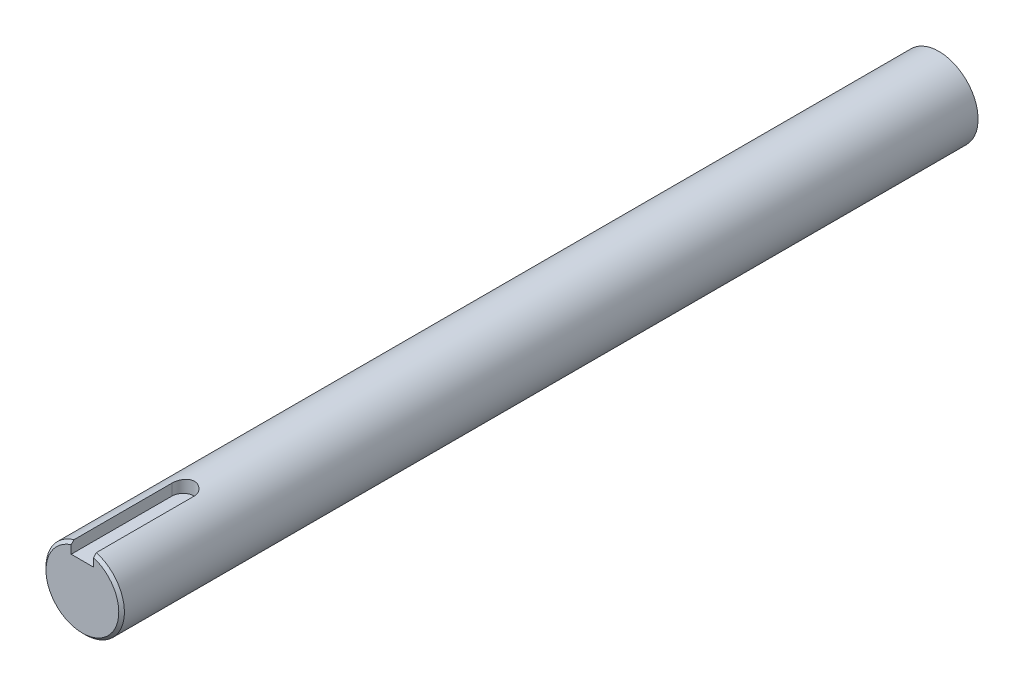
ISO-10303-21;
HEADER;
FILE_DESCRIPTION(('STEP AP214'),'2;1');
FILE_NAME('part.step','',(''),(''),'','','');
FILE_SCHEMA(('AUTOMOTIVE_DESIGN { 1 0 10303 214 1 1 1 1 }'));
ENDSEC;
DATA;
#1=APPLICATION_CONTEXT('core data for automotive mechanical design processes');
#2=APPLICATION_PROTOCOL_DEFINITION('international standard','automotive_design',2000,#1);
#3=PRODUCT_CONTEXT('',#1,'mechanical');
#4=PRODUCT('Part','Part','',(#3));
#5=PRODUCT_RELATED_PRODUCT_CATEGORY('part','',(#4));
#6=PRODUCT_DEFINITION_FORMATION('','',#4);
#7=PRODUCT_DEFINITION_CONTEXT('part definition',#1,'design');
#8=PRODUCT_DEFINITION('design','',#6,#7);
#9=PRODUCT_DEFINITION_SHAPE('','',#8);
#10=(LENGTH_UNIT() NAMED_UNIT(*) SI_UNIT(.MILLI.,.METRE.));
#11=(NAMED_UNIT(*) PLANE_ANGLE_UNIT() SI_UNIT($,.RADIAN.));
#12=(NAMED_UNIT(*) SI_UNIT($,.STERADIAN.) SOLID_ANGLE_UNIT());
#13=UNCERTAINTY_MEASURE_WITH_UNIT(LENGTH_MEASURE(1.E-05),#10,'distance_accuracy_value','');
#14=(GEOMETRIC_REPRESENTATION_CONTEXT(3) GLOBAL_UNCERTAINTY_ASSIGNED_CONTEXT((#13)) GLOBAL_UNIT_ASSIGNED_CONTEXT((#10,
#11,#12)) REPRESENTATION_CONTEXT('',''));
#15=CARTESIAN_POINT('',(0.,0.,0.));
#16=DIRECTION('',(0.,0.,1.));
#17=DIRECTION('',(1.,0.,0.));
#18=AXIS2_PLACEMENT_3D('',#15,#16,#17);
#19=CARTESIAN_POINT('',(0.,0.,98.));
#20=DIRECTION('',(0.,0.,-1.));
#21=DIRECTION('',(-1.,0.,0.));
#22=AXIS2_PLACEMENT_3D('',#19,#20,#21);
#23=CYLINDRICAL_SURFACE('',#22,7.);
#24=DIRECTION('',(0.,0.,-1.));
#25=VECTOR('',#24,1.);
#26=CARTESIAN_POINT('',(2.,6.70820393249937,98.));
#27=LINE('',#26,#25);
#28=CARTESIAN_POINT('',(2.,6.70820393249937,97.5));
#29=VERTEX_POINT('',#28);
#30=CARTESIAN_POINT('',(2.,6.70820393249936,80.));
#31=VERTEX_POINT('',#30);
#32=EDGE_CURVE('E103',#29,#31,#27,.T.);
#33=ORIENTED_EDGE('',*,*,#32,.F.);
#34=CARTESIAN_POINT('',(0.,0.,97.5));
#35=DIRECTION('',(0.,0.,1.));
#36=DIRECTION('',(1.,0.,0.));
#37=AXIS2_PLACEMENT_3D('',#34,#35,#36);
#38=CIRCLE('',#37,7.);
#39=CARTESIAN_POINT('',(-2.,6.70820393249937,97.5));
#40=VERTEX_POINT('',#39);
#41=EDGE_CURVE('E48',#29,#40,#38,.F.);
#42=ORIENTED_EDGE('',*,*,#41,.T.);
#43=DIRECTION('',(0.,0.,-1.));
#44=VECTOR('',#43,1.);
#45=CARTESIAN_POINT('',(-2.,6.70820393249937,98.));
#46=LINE('',#45,#44);
#47=CARTESIAN_POINT('',(-2.,6.70820393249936,80.));
#48=VERTEX_POINT('',#47);
#49=EDGE_CURVE('E114',#40,#48,#46,.T.);
#50=ORIENTED_EDGE('',*,*,#49,.T.);
#51=CARTESIAN_POINT('',(2.,6.70820393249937,80.));
#52=CARTESIAN_POINT('',(2.00000099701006,6.70819953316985,79.9449659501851));
#53=CARTESIAN_POINT('',(1.99772698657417,6.70888204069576,79.8899594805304));
#54=CARTESIAN_POINT('',(1.988664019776,6.71157572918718,79.7803637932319));
#55=CARTESIAN_POINT('',(1.98187599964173,6.71358663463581,79.7257744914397));
#56=CARTESIAN_POINT('',(1.95485062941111,6.72152750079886,79.563492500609));
#57=CARTESIAN_POINT('',(1.92795143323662,6.72936619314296,79.4569243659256));
#58=CARTESIAN_POINT('',(1.85729763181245,6.74920530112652,79.2500599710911));
#59=CARTESIAN_POINT('',(1.81354760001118,6.76120458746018,79.1497620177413));
#60=CARTESIAN_POINT('',(1.7105009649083,6.78800504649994,78.9578633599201));
#61=CARTESIAN_POINT('',(1.65119805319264,6.80280735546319,78.8662662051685));
#62=CARTESIAN_POINT('',(1.51692637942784,6.83401742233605,78.6918092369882));
#63=CARTESIAN_POINT('',(1.44159286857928,6.85045675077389,78.6092358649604));
#64=CARTESIAN_POINT('',(1.27817556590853,6.88281888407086,78.4577009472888));
#65=CARTESIAN_POINT('',(1.19008966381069,6.89874160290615,78.3887416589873));
#66=CARTESIAN_POINT('',(1.00164390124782,6.92863365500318,78.2651698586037));
#67=CARTESIAN_POINT('',(0.901086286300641,6.94256116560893,78.210847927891));
#68=CARTESIAN_POINT('',(0.69180361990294,6.96652585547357,78.1199966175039));
#69=CARTESIAN_POINT('',(0.583080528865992,6.9765639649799,78.0834629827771));
#70=CARTESIAN_POINT('',(0.363559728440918,6.99139511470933,78.0301658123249));
#71=CARTESIAN_POINT('',(0.252890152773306,6.9963181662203,78.0129113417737));
#72=CARTESIAN_POINT('',(0.0301224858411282,7.0008209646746,77.9971132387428));
#73=CARTESIAN_POINT('',(-0.0819753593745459,7.00040161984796,77.9985664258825));
#74=CARTESIAN_POINT('',(-0.300980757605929,6.99436005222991,78.0198064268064));
#75=CARTESIAN_POINT('',(-0.40794465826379,6.98888865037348,78.0390618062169));
#76=CARTESIAN_POINT('',(-0.617053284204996,6.97353876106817,78.0944954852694));
#77=CARTESIAN_POINT('',(-0.719197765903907,6.96366005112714,78.1306746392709));
#78=CARTESIAN_POINT('',(-0.917074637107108,6.94039022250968,78.2193097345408));
#79=CARTESIAN_POINT('',(-1.01272458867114,6.92696183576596,78.2719395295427));
#80=CARTESIAN_POINT('',(-1.19400864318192,6.89802743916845,78.3918457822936));
#81=CARTESIAN_POINT('',(-1.27964070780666,6.88252100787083,78.4591252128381));
#82=CARTESIAN_POINT('',(-1.4416242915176,6.85045847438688,78.6091975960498));
#83=CARTESIAN_POINT('',(-1.51754611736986,6.83388462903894,78.6924510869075));
#84=CARTESIAN_POINT('',(-1.65448071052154,6.8020328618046,78.8706972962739));
#85=CARTESIAN_POINT('',(-1.71548924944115,6.78675530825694,78.9656933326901));
#86=CARTESIAN_POINT('',(-1.82126577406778,6.75914312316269,79.165787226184));
#87=CARTESIAN_POINT('',(-1.86589126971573,6.74683461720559,79.2709641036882));
#88=CARTESIAN_POINT('',(-1.93662306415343,6.72687625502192,79.4877120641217));
#89=CARTESIAN_POINT('',(-1.96275743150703,6.71921934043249,79.5992731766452));
#90=CARTESIAN_POINT('',(-1.98612021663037,6.71232934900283,79.7598794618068));
#91=CARTESIAN_POINT('',(-1.99132502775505,6.71078540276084,79.807779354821));
#92=CARTESIAN_POINT('',(-1.99826154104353,6.7087227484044,79.9037782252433));
#93=CARTESIAN_POINT('',(-1.99999854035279,6.70820247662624,79.9518767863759));
#94=CARTESIAN_POINT('',(-2.,6.70820393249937,80.));
#95=B_SPLINE_CURVE_WITH_KNOTS('',3,(#51,#52,#53,#54,#55,#56,#57,#58,#59,#60,#61,#62,#63,#64,#65,
#66,#67,#68,#69,#70,#71,#72,#73,#74,#75,#76,#77,#78,#79,#80,#81,#82,#83,#84,#85,#86,#87,#88,#89,
#90,#91,#92,#93,#94),.UNSPECIFIED.,.F.,.F.,(4,2,2,2,2,2,2,2,2,2,2,2,2,2,2,2,2,2,2,2,2,4),(0.,
0.164996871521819,0.32995953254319,0.658815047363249,0.987581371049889,1.3164812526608,
1.65386790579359,1.99131045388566,2.33502692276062,2.67866113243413,3.01332990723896,
3.34794178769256,3.67287650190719,3.99782762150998,4.32633613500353,4.65491137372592,
4.99498620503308,5.33515734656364,5.67822068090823,6.0207621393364,6.16526974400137,
6.30955644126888),.UNSPECIFIED.);
#96=EDGE_CURVE('E97',#31,#48,#95,.T.);
#97=ORIENTED_EDGE('',*,*,#96,.F.);
#98=EDGE_LOOP('',(#33,#42,#50,#97));
#99=FACE_BOUND('',#98,.T.);
#100=CARTESIAN_POINT('',(0.,0.,-55.));
#101=DIRECTION('',(0.,0.,-1.));
#102=DIRECTION('',(-1.,0.,0.));
#103=AXIS2_PLACEMENT_3D('',#100,#101,#102);
#104=CIRCLE('',#103,7.);
#105=CARTESIAN_POINT('',(-7.,0.,-55.));
#106=VERTEX_POINT('',#105);
#107=EDGE_CURVE('E98',#106,#106,#104,.T.);
#108=ORIENTED_EDGE('',*,*,#107,.F.);
#109=EDGE_LOOP('',(#108));
#110=FACE_BOUND('',#109,.T.);
#111=ADVANCED_FACE('F35',(#99,#110),#23,.T.);
#112=CARTESIAN_POINT('',(2.,4.7,98.));
#113=DIRECTION('',(1.,0.,0.));
#114=DIRECTION('',(0.,1.,0.));
#115=AXIS2_PLACEMENT_3D('',#112,#113,#114);
#116=PLANE('',#115);
#117=DIRECTION('',(0.,-1.,0.));
#118=VECTOR('',#117,1.);
#119=CARTESIAN_POINT('',(2.,4.7,98.));
#120=LINE('',#119,#118);
#121=CARTESIAN_POINT('',(2.,6.18465843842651,98.));
#122=VERTEX_POINT('',#121);
#123=CARTESIAN_POINT('',(2.,4.7,98.));
#124=VERTEX_POINT('',#123);
#125=EDGE_CURVE('E104',#122,#124,#120,.T.);
#126=ORIENTED_EDGE('',*,*,#125,.F.);
#127=CARTESIAN_POINT('',(2.,6.18465843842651,98.));
#128=CARTESIAN_POINT('',(2.,6.27206463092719,97.9168222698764));
#129=CARTESIAN_POINT('',(2.,6.35939651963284,97.8335667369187));
#130=CARTESIAN_POINT('',(2.,6.53391168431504,97.6669000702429));
#131=CARTESIAN_POINT('',(2.,6.62109496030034,97.583488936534));
#132=CARTESIAN_POINT('',(2.,6.70820393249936,97.5));
#133=B_SPLINE_CURVE_WITH_KNOTS('',3,(#127,#128,#129,#130,#131,#132),.UNSPECIFIED.,.F.,.F.,(4,2,
4),(0.,0.361973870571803,0.723947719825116),.UNSPECIFIED.);
#134=EDGE_CURVE('E62',#122,#29,#133,.T.);
#135=ORIENTED_EDGE('',*,*,#134,.T.);
#136=ORIENTED_EDGE('',*,*,#32,.T.);
#137=DIRECTION('',(0.,1.,0.));
#138=VECTOR('',#137,1.);
#139=CARTESIAN_POINT('',(2.,4.7,80.));
#140=LINE('',#139,#138);
#141=CARTESIAN_POINT('',(2.,4.7,80.));
#142=VERTEX_POINT('',#141);
#143=EDGE_CURVE('E89',#142,#31,#140,.T.);
#144=ORIENTED_EDGE('',*,*,#143,.F.);
#145=DIRECTION('',(0.,0.,-1.));
#146=VECTOR('',#145,1.);
#147=CARTESIAN_POINT('',(2.,4.7,98.));
#148=LINE('',#147,#146);
#149=EDGE_CURVE('E102',#124,#142,#148,.T.);
#150=ORIENTED_EDGE('',*,*,#149,.F.);
#151=EDGE_LOOP('',(#126,#135,#136,#144,#150));
#152=FACE_BOUND('',#151,.T.);
#153=ADVANCED_FACE('F101',(#152),#116,.F.);
#154=CARTESIAN_POINT('',(2.,4.7,98.));
#155=DIRECTION('',(0.,-1.,0.));
#156=DIRECTION('',(1.,0.,0.));
#157=AXIS2_PLACEMENT_3D('',#154,#155,#156);
#158=PLANE('',#157);
#159=ORIENTED_EDGE('',*,*,#149,.T.);
#160=CARTESIAN_POINT('',(0.,4.7,80.));
#161=DIRECTION('',(0.,1.,0.));
#162=DIRECTION('',(-1.,0.,0.));
#163=AXIS2_PLACEMENT_3D('',#160,#161,#162);
#164=CIRCLE('',#163,2.);
#165=CARTESIAN_POINT('',(-2.,4.7,80.));
#166=VERTEX_POINT('',#165);
#167=EDGE_CURVE('E85',#142,#166,#164,.T.);
#168=ORIENTED_EDGE('',*,*,#167,.T.);
#169=DIRECTION('',(0.,0.,-1.));
#170=VECTOR('',#169,1.);
#171=CARTESIAN_POINT('',(-2.,4.7,98.));
#172=LINE('',#171,#170);
#173=CARTESIAN_POINT('',(-2.,4.7,98.));
#174=VERTEX_POINT('',#173);
#175=EDGE_CURVE('E110',#174,#166,#172,.T.);
#176=ORIENTED_EDGE('',*,*,#175,.F.);
#177=DIRECTION('',(-1.,0.,0.));
#178=VECTOR('',#177,1.);
#179=CARTESIAN_POINT('',(2.,4.7,98.));
#180=LINE('',#179,#178);
#181=EDGE_CURVE('E108',#124,#174,#180,.T.);
#182=ORIENTED_EDGE('',*,*,#181,.F.);
#183=EDGE_LOOP('',(#159,#168,#176,#182));
#184=FACE_BOUND('',#183,.T.);
#185=ADVANCED_FACE('F107',(#184),#158,.F.);
#186=CARTESIAN_POINT('',(-2.,4.7,98.));
#187=DIRECTION('',(-1.,0.,0.));
#188=DIRECTION('',(0.,0.,1.));
#189=AXIS2_PLACEMENT_3D('',#186,#187,#188);
#190=PLANE('',#189);
#191=ORIENTED_EDGE('',*,*,#49,.F.);
#192=CARTESIAN_POINT('',(-2.,6.70820393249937,97.5));
#193=CARTESIAN_POINT('',(-2.,6.62109496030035,97.583488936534));
#194=CARTESIAN_POINT('',(-2.,6.53391168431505,97.6669000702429));
#195=CARTESIAN_POINT('',(-2.,6.35939651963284,97.8335667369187));
#196=CARTESIAN_POINT('',(-2.,6.27206463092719,97.9168222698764));
#197=CARTESIAN_POINT('',(-2.,6.18465843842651,98.));
#198=B_SPLINE_CURVE_WITH_KNOTS('',3,(#192,#193,#194,#195,#196,#197),.UNSPECIFIED.,.F.,.F.,(4,2,
4),(0.,0.361973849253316,0.723947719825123),.UNSPECIFIED.);
#199=CARTESIAN_POINT('',(-2.,6.18465843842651,98.));
#200=VERTEX_POINT('',#199);
#201=EDGE_CURVE('E11',#40,#200,#198,.T.);
#202=ORIENTED_EDGE('',*,*,#201,.T.);
#203=DIRECTION('',(0.,1.,0.));
#204=VECTOR('',#203,1.);
#205=CARTESIAN_POINT('',(-2.,4.7,98.));
#206=LINE('',#205,#204);
#207=EDGE_CURVE('E160',#174,#200,#206,.T.);
#208=ORIENTED_EDGE('',*,*,#207,.F.);
#209=ORIENTED_EDGE('',*,*,#175,.T.);
#210=DIRECTION('',(0.,-1.,0.));
#211=VECTOR('',#210,1.);
#212=CARTESIAN_POINT('',(-2.,4.7,80.));
#213=LINE('',#212,#211);
#214=EDGE_CURVE('E92',#48,#166,#213,.T.);
#215=ORIENTED_EDGE('',*,*,#214,.F.);
#216=EDGE_LOOP('',(#191,#202,#208,#209,#215));
#217=FACE_BOUND('',#216,.T.);
#218=ADVANCED_FACE('F125',(#217),#190,.F.);
#219=CARTESIAN_POINT('',(0.,0.,98.));
#220=DIRECTION('',(0.,0.,1.));
#221=DIRECTION('',(1.,0.,0.));
#222=AXIS2_PLACEMENT_3D('',#219,#220,#221);
#223=PLANE('',#222);
#224=ORIENTED_EDGE('',*,*,#207,.T.);
#225=CARTESIAN_POINT('',(0.,0.,98.));
#226=DIRECTION('',(0.,0.,1.));
#227=DIRECTION('',(1.,0.,0.));
#228=AXIS2_PLACEMENT_3D('',#225,#226,#227);
#229=CIRCLE('',#228,6.50000000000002);
#230=EDGE_CURVE('E109',#200,#122,#229,.T.);
#231=ORIENTED_EDGE('',*,*,#230,.T.);
#232=ORIENTED_EDGE('',*,*,#125,.T.);
#233=ORIENTED_EDGE('',*,*,#181,.T.);
#234=EDGE_LOOP('',(#224,#231,#232,#233));
#235=FACE_BOUND('',#234,.T.);
#236=ADVANCED_FACE('F129',(#235),#223,.T.);
#237=CARTESIAN_POINT('',(0.,84.7,80.));
#238=DIRECTION('',(0.,-1.,0.));
#239=DIRECTION('',(1.,0.,0.));
#240=AXIS2_PLACEMENT_3D('',#237,#238,#239);
#241=CYLINDRICAL_SURFACE('',#240,2.);
#242=ORIENTED_EDGE('',*,*,#96,.T.);
#243=ORIENTED_EDGE('',*,*,#214,.T.);
#244=ORIENTED_EDGE('',*,*,#167,.F.);
#245=ORIENTED_EDGE('',*,*,#143,.T.);
#246=EDGE_LOOP('',(#242,#243,#244,#245));
#247=FACE_BOUND('',#246,.T.);
#248=ADVANCED_FACE('F88',(#247),#241,.F.);
#249=CARTESIAN_POINT('',(0.,0.,98.));
#250=DIRECTION('',(0.,0.,-1.));
#251=DIRECTION('',(-1.,0.,0.));
#252=AXIS2_PLACEMENT_3D('',#249,#250,#251);
#253=CONICAL_SURFACE('',#252,6.50000000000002,0.785398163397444);
#254=ORIENTED_EDGE('',*,*,#201,.F.);
#255=ORIENTED_EDGE('',*,*,#41,.F.);
#256=ORIENTED_EDGE('',*,*,#134,.F.);
#257=ORIENTED_EDGE('',*,*,#230,.F.);
#258=EDGE_LOOP('',(#254,#255,#256,#257));
#259=FACE_BOUND('',#258,.T.);
#260=ADVANCED_FACE('F37',(#259),#253,.T.);
#261=CARTESIAN_POINT('',(0.,0.,-55.));
#262=DIRECTION('',(0.,0.,-1.));
#263=DIRECTION('',(-1.,0.,0.));
#264=AXIS2_PLACEMENT_3D('',#261,#262,#263);
#265=PLANE('',#264);
#266=ORIENTED_EDGE('',*,*,#107,.T.);
#267=EDGE_LOOP('',(#266));
#268=FACE_BOUND('',#267,.T.);
#269=ADVANCED_FACE('F144',(#268),#265,.T.);
#270=CLOSED_SHELL('',(#111,#153,#185,#218,#236,#248,#260,#269));
#271=MANIFOLD_SOLID_BREP('B2',#270);
#272=ADVANCED_BREP_SHAPE_REPRESENTATION('',(#18,#271),#14);
#273=SHAPE_DEFINITION_REPRESENTATION(#9,#272);
ENDSEC;
END-ISO-10303-21;
